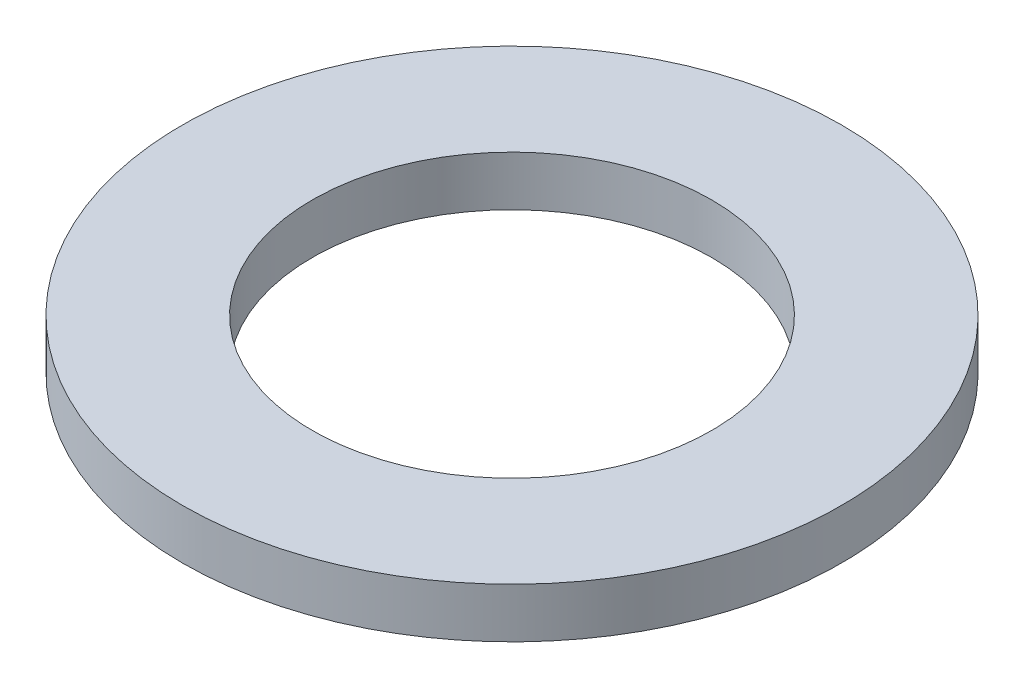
ISO-10303-21;
HEADER;
FILE_DESCRIPTION(('STEP AP214'),'2;1');
FILE_NAME('part.step','',(''),(''),'','','');
FILE_SCHEMA(('AUTOMOTIVE_DESIGN { 1 0 10303 214 1 1 1 1 }'));
ENDSEC;
DATA;
#1=APPLICATION_CONTEXT('core data for automotive mechanical design processes');
#2=APPLICATION_PROTOCOL_DEFINITION('international standard','automotive_design',2000,#1);
#3=PRODUCT_CONTEXT('',#1,'mechanical');
#4=PRODUCT('Part','Part','',(#3));
#5=PRODUCT_RELATED_PRODUCT_CATEGORY('part','',(#4));
#6=PRODUCT_DEFINITION_FORMATION('','',#4);
#7=PRODUCT_DEFINITION_CONTEXT('part definition',#1,'design');
#8=PRODUCT_DEFINITION('design','',#6,#7);
#9=PRODUCT_DEFINITION_SHAPE('','',#8);
#10=(LENGTH_UNIT() NAMED_UNIT(*) SI_UNIT(.MILLI.,.METRE.));
#11=(NAMED_UNIT(*) PLANE_ANGLE_UNIT() SI_UNIT($,.RADIAN.));
#12=(NAMED_UNIT(*) SI_UNIT($,.STERADIAN.) SOLID_ANGLE_UNIT());
#13=UNCERTAINTY_MEASURE_WITH_UNIT(LENGTH_MEASURE(1.E-05),#10,'distance_accuracy_value','');
#14=(GEOMETRIC_REPRESENTATION_CONTEXT(3) GLOBAL_UNCERTAINTY_ASSIGNED_CONTEXT((#13)) GLOBAL_UNIT_ASSIGNED_CONTEXT((#10,
#11,#12)) REPRESENTATION_CONTEXT('',''));
#15=CARTESIAN_POINT('',(0.,0.,0.));
#16=DIRECTION('',(0.,0.,1.));
#17=DIRECTION('',(1.,0.,0.));
#18=AXIS2_PLACEMENT_3D('',#15,#16,#17);
#19=CARTESIAN_POINT('',(0.,0.,0.));
#20=DIRECTION('',(0.,1.,0.));
#21=DIRECTION('',(0.,0.,1.));
#22=AXIS2_PLACEMENT_3D('',#19,#20,#21);
#23=PLANE('',#22);
#24=CARTESIAN_POINT('',(0.,0.,0.));
#25=DIRECTION('',(0.,-1.,0.));
#26=DIRECTION('',(0.,0.,-1.));
#27=AXIS2_PLACEMENT_3D('',#24,#25,#26);
#28=CIRCLE('',#27,2.);
#29=CARTESIAN_POINT('',(0.,0.,-2.));
#30=VERTEX_POINT('',#29);
#31=EDGE_CURVE('E27',#30,#30,#28,.F.);
#32=ORIENTED_EDGE('',*,*,#31,.T.);
#33=EDGE_LOOP('',(#32));
#34=FACE_BOUND('',#33,.T.);
#35=CARTESIAN_POINT('',(0.,0.,0.));
#36=DIRECTION('',(0.,-1.,0.));
#37=DIRECTION('',(0.,0.,-1.));
#38=AXIS2_PLACEMENT_3D('',#35,#36,#37);
#39=CIRCLE('',#38,3.3);
#40=CARTESIAN_POINT('',(0.,0.,-3.3));
#41=VERTEX_POINT('',#40);
#42=EDGE_CURVE('E18',#41,#41,#39,.F.);
#43=ORIENTED_EDGE('',*,*,#42,.F.);
#44=EDGE_LOOP('',(#43));
#45=FACE_BOUND('',#44,.T.);
#46=ADVANCED_FACE('F15',(#34,#45),#23,.F.);
#47=CARTESIAN_POINT('',(0.,0.5,0.));
#48=DIRECTION('',(0.,-1.,0.));
#49=DIRECTION('',(0.,0.,-1.));
#50=AXIS2_PLACEMENT_3D('',#47,#48,#49);
#51=CYLINDRICAL_SURFACE('',#50,3.3);
#52=ORIENTED_EDGE('',*,*,#42,.T.);
#53=EDGE_LOOP('',(#52));
#54=FACE_BOUND('',#53,.T.);
#55=CARTESIAN_POINT('',(0.,0.5,0.));
#56=DIRECTION('',(0.,-1.,0.));
#57=DIRECTION('',(0.,0.,-1.));
#58=AXIS2_PLACEMENT_3D('',#55,#56,#57);
#59=CIRCLE('',#58,3.3);
#60=CARTESIAN_POINT('',(0.,0.5,-3.3));
#61=VERTEX_POINT('',#60);
#62=EDGE_CURVE('E22',#61,#61,#59,.F.);
#63=ORIENTED_EDGE('',*,*,#62,.F.);
#64=EDGE_LOOP('',(#63));
#65=FACE_BOUND('',#64,.T.);
#66=ADVANCED_FACE('F35',(#54,#65),#51,.T.);
#67=CARTESIAN_POINT('',(0.,0.5,0.));
#68=DIRECTION('',(0.,-1.,0.));
#69=DIRECTION('',(0.,0.,-1.));
#70=AXIS2_PLACEMENT_3D('',#67,#68,#69);
#71=CYLINDRICAL_SURFACE('',#70,2.);
#72=CARTESIAN_POINT('',(0.,0.5,0.));
#73=DIRECTION('',(0.,-1.,0.));
#74=DIRECTION('',(0.,0.,-1.));
#75=AXIS2_PLACEMENT_3D('',#72,#73,#74);
#76=CIRCLE('',#75,2.);
#77=CARTESIAN_POINT('',(0.,0.5,-2.));
#78=VERTEX_POINT('',#77);
#79=EDGE_CURVE('E10',#78,#78,#76,.T.);
#80=ORIENTED_EDGE('',*,*,#79,.F.);
#81=EDGE_LOOP('',(#80));
#82=FACE_BOUND('',#81,.T.);
#83=ORIENTED_EDGE('',*,*,#31,.F.);
#84=EDGE_LOOP('',(#83));
#85=FACE_BOUND('',#84,.T.);
#86=ADVANCED_FACE('F43',(#82,#85),#71,.F.);
#87=CARTESIAN_POINT('',(0.,0.5,0.));
#88=DIRECTION('',(0.,1.,0.));
#89=DIRECTION('',(0.,0.,1.));
#90=AXIS2_PLACEMENT_3D('',#87,#88,#89);
#91=PLANE('',#90);
#92=ORIENTED_EDGE('',*,*,#79,.T.);
#93=EDGE_LOOP('',(#92));
#94=FACE_BOUND('',#93,.T.);
#95=ORIENTED_EDGE('',*,*,#62,.T.);
#96=EDGE_LOOP('',(#95));
#97=FACE_BOUND('',#96,.T.);
#98=ADVANCED_FACE('F44',(#94,#97),#91,.T.);
#99=CLOSED_SHELL('',(#46,#66,#86,#98));
#100=MANIFOLD_SOLID_BREP('B1',#99);
#101=ADVANCED_BREP_SHAPE_REPRESENTATION('',(#18,#100),#14);
#102=SHAPE_DEFINITION_REPRESENTATION(#9,#101);
ENDSEC;
END-ISO-10303-21;
